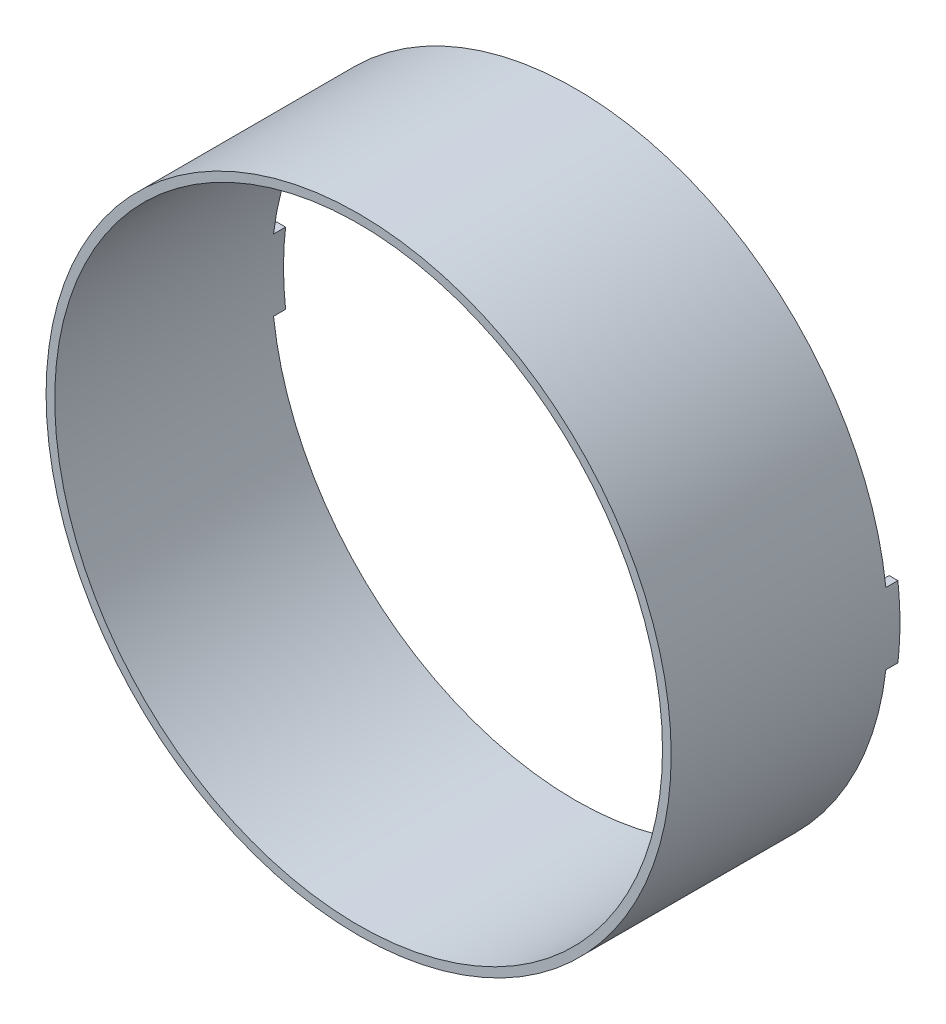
ISO-10303-21;
HEADER;
FILE_DESCRIPTION(('STEP AP214'),'2;1');
FILE_NAME('part.step','',(''),(''),'','','');
FILE_SCHEMA(('AUTOMOTIVE_DESIGN { 1 0 10303 214 1 1 1 1 }'));
ENDSEC;
DATA;
#1=APPLICATION_CONTEXT('core data for automotive mechanical design processes');
#2=APPLICATION_PROTOCOL_DEFINITION('international standard','automotive_design',2000,#1);
#3=PRODUCT_CONTEXT('',#1,'mechanical');
#4=PRODUCT('Part','Part','',(#3));
#5=PRODUCT_RELATED_PRODUCT_CATEGORY('part','',(#4));
#6=PRODUCT_DEFINITION_FORMATION('','',#4);
#7=PRODUCT_DEFINITION_CONTEXT('part definition',#1,'design');
#8=PRODUCT_DEFINITION('design','',#6,#7);
#9=PRODUCT_DEFINITION_SHAPE('','',#8);
#10=(LENGTH_UNIT() NAMED_UNIT(*) SI_UNIT(.MILLI.,.METRE.));
#11=(NAMED_UNIT(*) PLANE_ANGLE_UNIT() SI_UNIT($,.RADIAN.));
#12=(NAMED_UNIT(*) SI_UNIT($,.STERADIAN.) SOLID_ANGLE_UNIT());
#13=UNCERTAINTY_MEASURE_WITH_UNIT(LENGTH_MEASURE(1.E-05),#10,'distance_accuracy_value','');
#14=(GEOMETRIC_REPRESENTATION_CONTEXT(3) GLOBAL_UNCERTAINTY_ASSIGNED_CONTEXT((#13)) GLOBAL_UNIT_ASSIGNED_CONTEXT((#10,
#11,#12)) REPRESENTATION_CONTEXT('',''));
#15=CARTESIAN_POINT('',(0.,0.,0.));
#16=DIRECTION('',(0.,0.,1.));
#17=DIRECTION('',(1.,0.,0.));
#18=AXIS2_PLACEMENT_3D('',#15,#16,#17);
#19=CARTESIAN_POINT('',(0.,39.1553072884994,0.));
#20=DIRECTION('',(0.,0.,1.));
#21=DIRECTION('',(1.,0.,0.));
#22=AXIS2_PLACEMENT_3D('',#19,#20,#21);
#23=PLANE('',#22);
#24=CARTESIAN_POINT('',(0.,39.1553072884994,0.));
#25=DIRECTION('',(0.,0.,1.));
#26=DIRECTION('',(1.,0.,0.));
#27=AXIS2_PLACEMENT_3D('',#24,#25,#26);
#28=CIRCLE('',#27,63.1000000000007);
#29=CARTESIAN_POINT('',(62.6645832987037,46.5553072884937,0.));
#30=VERTEX_POINT('',#29);
#31=CARTESIAN_POINT('',(-62.6645832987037,46.5553072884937,0.));
#32=VERTEX_POINT('',#31);
#33=EDGE_CURVE('E122',#30,#32,#28,.T.);
#34=ORIENTED_EDGE('',*,*,#33,.T.);
#35=DIRECTION('',(-1.,0.,0.));
#36=VECTOR('',#35,1.);
#37=CARTESIAN_POINT('',(-62.6645832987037,46.5553072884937,0.));
#38=LINE('',#37,#36);
#39=CARTESIAN_POINT('',(-64.4767399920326,46.5553072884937,0.));
#40=VERTEX_POINT('',#39);
#41=EDGE_CURVE('E131',#32,#40,#38,.T.);
#42=ORIENTED_EDGE('',*,*,#41,.T.);
#43=CARTESIAN_POINT('',(0.,39.1553072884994,0.));
#44=DIRECTION('',(0.,0.,1.));
#45=DIRECTION('',(1.,0.,0.));
#46=AXIS2_PLACEMENT_3D('',#43,#44,#45);
#47=CIRCLE('',#46,64.9000000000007);
#48=CARTESIAN_POINT('',(64.4767399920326,46.5553072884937,0.));
#49=VERTEX_POINT('',#48);
#50=EDGE_CURVE('E152',#49,#40,#47,.T.);
#51=ORIENTED_EDGE('',*,*,#50,.F.);
#52=DIRECTION('',(-1.,0.,0.));
#53=VECTOR('',#52,1.);
#54=CARTESIAN_POINT('',(64.4767399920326,46.5553072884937,0.));
#55=LINE('',#54,#53);
#56=EDGE_CURVE('E140',#49,#30,#55,.T.);
#57=ORIENTED_EDGE('',*,*,#56,.T.);
#58=EDGE_LOOP('',(#34,#42,#51,#57));
#59=FACE_BOUND('',#58,.T.);
#60=ADVANCED_FACE('F41',(#59),#23,.F.);
#61=CARTESIAN_POINT('',(62.6645832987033,31.7553072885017,-2.5));
#62=DIRECTION('',(0.,-1.,0.));
#63=DIRECTION('',(0.,0.,-1.));
#64=AXIS2_PLACEMENT_3D('',#61,#62,#63);
#65=PLANE('',#64);
#66=DIRECTION('',(1.,0.,0.));
#67=VECTOR('',#66,1.);
#68=CARTESIAN_POINT('',(62.6645832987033,31.7553072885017,0.));
#69=LINE('',#68,#67);
#70=CARTESIAN_POINT('',(62.6645832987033,31.7553072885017,0.));
#71=VERTEX_POINT('',#70);
#72=CARTESIAN_POINT('',(64.4767399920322,31.7553072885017,0.));
#73=VERTEX_POINT('',#72);
#74=EDGE_CURVE('E151',#71,#73,#69,.T.);
#75=ORIENTED_EDGE('',*,*,#74,.F.);
#76=DIRECTION('',(0.,0.,1.));
#77=VECTOR('',#76,1.);
#78=CARTESIAN_POINT('',(62.6645832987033,31.7553072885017,-2.5));
#79=LINE('',#78,#77);
#80=CARTESIAN_POINT('',(62.6645832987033,31.7553072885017,-2.5));
#81=VERTEX_POINT('',#80);
#82=EDGE_CURVE('E11',#81,#71,#79,.T.);
#83=ORIENTED_EDGE('',*,*,#82,.F.);
#84=DIRECTION('',(1.,0.,0.));
#85=VECTOR('',#84,1.);
#86=CARTESIAN_POINT('',(62.6645832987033,31.7553072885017,-2.5));
#87=LINE('',#86,#85);
#88=CARTESIAN_POINT('',(64.4767399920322,31.7553072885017,-2.5));
#89=VERTEX_POINT('',#88);
#90=EDGE_CURVE('E154',#81,#89,#87,.T.);
#91=ORIENTED_EDGE('',*,*,#90,.T.);
#92=DIRECTION('',(0.,0.,1.));
#93=VECTOR('',#92,1.);
#94=CARTESIAN_POINT('',(64.4767399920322,31.7553072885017,-2.5));
#95=LINE('',#94,#93);
#96=EDGE_CURVE('E45',#89,#73,#95,.T.);
#97=ORIENTED_EDGE('',*,*,#96,.T.);
#98=EDGE_LOOP('',(#75,#83,#91,#97));
#99=FACE_BOUND('',#98,.T.);
#100=ADVANCED_FACE('F43',(#99),#65,.T.);
#101=CARTESIAN_POINT('',(0.,39.1553072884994,-2.5));
#102=DIRECTION('',(0.,0.,1.));
#103=DIRECTION('',(1.,0.,0.));
#104=AXIS2_PLACEMENT_3D('',#101,#102,#103);
#105=CYLINDRICAL_SURFACE('',#104,63.1000000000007);
#106=ORIENTED_EDGE('',*,*,#82,.T.);
#107=CARTESIAN_POINT('',(-62.6645832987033,31.7553072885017,0.));
#108=VERTEX_POINT('',#107);
#109=EDGE_CURVE('E84',#108,#71,#28,.T.);
#110=ORIENTED_EDGE('',*,*,#109,.F.);
#111=DIRECTION('',(0.,0.,1.));
#112=VECTOR('',#111,1.);
#113=CARTESIAN_POINT('',(-62.6645832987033,31.7553072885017,-2.5));
#114=LINE('',#113,#112);
#115=CARTESIAN_POINT('',(-62.6645832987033,31.7553072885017,-2.5));
#116=VERTEX_POINT('',#115);
#117=EDGE_CURVE('E128',#116,#108,#114,.T.);
#118=ORIENTED_EDGE('',*,*,#117,.F.);
#119=CARTESIAN_POINT('',(0.,39.1553072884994,-2.5));
#120=DIRECTION('',(0.,0.,1.));
#121=DIRECTION('',(1.,0.,0.));
#122=AXIS2_PLACEMENT_3D('',#119,#120,#121);
#123=CIRCLE('',#122,63.1000000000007);
#124=CARTESIAN_POINT('',(-62.6645832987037,46.5553072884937,-2.5));
#125=VERTEX_POINT('',#124);
#126=EDGE_CURVE('E124',#125,#116,#123,.T.);
#127=ORIENTED_EDGE('',*,*,#126,.F.);
#128=DIRECTION('',(0.,0.,1.));
#129=VECTOR('',#128,1.);
#130=CARTESIAN_POINT('',(-62.6645832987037,46.5553072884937,-2.5));
#131=LINE('',#130,#129);
#132=EDGE_CURVE('E116',#125,#32,#131,.T.);
#133=ORIENTED_EDGE('',*,*,#132,.T.);
#134=ORIENTED_EDGE('',*,*,#33,.F.);
#135=DIRECTION('',(0.,0.,1.));
#136=VECTOR('',#135,1.);
#137=CARTESIAN_POINT('',(62.6645832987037,46.5553072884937,-2.5));
#138=LINE('',#137,#136);
#139=CARTESIAN_POINT('',(62.6645832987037,46.5553072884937,-2.5));
#140=VERTEX_POINT('',#139);
#141=EDGE_CURVE('E50',#140,#30,#138,.T.);
#142=ORIENTED_EDGE('',*,*,#141,.F.);
#143=CARTESIAN_POINT('',(0.,39.1553072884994,-2.5));
#144=DIRECTION('',(0.,0.,1.));
#145=DIRECTION('',(1.,0.,0.));
#146=AXIS2_PLACEMENT_3D('',#143,#144,#145);
#147=CIRCLE('',#146,63.1000000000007);
#148=EDGE_CURVE('E161',#81,#140,#147,.T.);
#149=ORIENTED_EDGE('',*,*,#148,.F.);
#150=EDGE_LOOP('',(#106,#110,#118,#127,#133,#134,#142,#149));
#151=FACE_BOUND('',#150,.T.);
#152=CARTESIAN_POINT('',(0.,39.1553072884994,45.));
#153=DIRECTION('',(0.,0.,1.));
#154=DIRECTION('',(1.,0.,0.));
#155=AXIS2_PLACEMENT_3D('',#152,#153,#154);
#156=CIRCLE('',#155,63.1000000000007);
#157=CARTESIAN_POINT('',(63.1000000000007,39.1553072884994,45.));
#158=VERTEX_POINT('',#157);
#159=EDGE_CURVE('E141',#158,#158,#156,.T.);
#160=ORIENTED_EDGE('',*,*,#159,.T.);
#161=EDGE_LOOP('',(#160));
#162=FACE_BOUND('',#161,.T.);
#163=ADVANCED_FACE('F118',(#151,#162),#105,.F.);
#164=CARTESIAN_POINT('',(64.4767399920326,46.5553072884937,-2.5));
#165=DIRECTION('',(0.,1.,0.));
#166=DIRECTION('',(0.,0.,1.));
#167=AXIS2_PLACEMENT_3D('',#164,#165,#166);
#168=PLANE('',#167);
#169=ORIENTED_EDGE('',*,*,#56,.F.);
#170=DIRECTION('',(0.,0.,1.));
#171=VECTOR('',#170,1.);
#172=CARTESIAN_POINT('',(64.4767399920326,46.5553072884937,-2.5));
#173=LINE('',#172,#171);
#174=CARTESIAN_POINT('',(64.4767399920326,46.5553072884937,-2.5));
#175=VERTEX_POINT('',#174);
#176=EDGE_CURVE('E165',#175,#49,#173,.T.);
#177=ORIENTED_EDGE('',*,*,#176,.F.);
#178=DIRECTION('',(-1.,0.,0.));
#179=VECTOR('',#178,1.);
#180=CARTESIAN_POINT('',(64.4767399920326,46.5553072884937,-2.5));
#181=LINE('',#180,#179);
#182=EDGE_CURVE('E158',#175,#140,#181,.T.);
#183=ORIENTED_EDGE('',*,*,#182,.T.);
#184=ORIENTED_EDGE('',*,*,#141,.T.);
#185=EDGE_LOOP('',(#169,#177,#183,#184));
#186=FACE_BOUND('',#185,.T.);
#187=ADVANCED_FACE('F193',(#186),#168,.T.);
#188=CARTESIAN_POINT('',(0.,39.1553072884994,-2.5));
#189=DIRECTION('',(0.,0.,1.));
#190=DIRECTION('',(1.,0.,0.));
#191=AXIS2_PLACEMENT_3D('',#188,#189,#190);
#192=CYLINDRICAL_SURFACE('',#191,64.9000000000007);
#193=ORIENTED_EDGE('',*,*,#176,.T.);
#194=ORIENTED_EDGE('',*,*,#50,.T.);
#195=DIRECTION('',(0.,0.,1.));
#196=VECTOR('',#195,1.);
#197=CARTESIAN_POINT('',(-64.4767399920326,46.5553072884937,-2.5));
#198=LINE('',#197,#196);
#199=CARTESIAN_POINT('',(-64.4767399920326,46.5553072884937,-2.5));
#200=VERTEX_POINT('',#199);
#201=EDGE_CURVE('E133',#200,#40,#198,.T.);
#202=ORIENTED_EDGE('',*,*,#201,.F.);
#203=CARTESIAN_POINT('',(0.,39.1553072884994,-2.5));
#204=DIRECTION('',(0.,0.,1.));
#205=DIRECTION('',(1.,0.,0.));
#206=AXIS2_PLACEMENT_3D('',#203,#204,#205);
#207=CIRCLE('',#206,64.9000000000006);
#208=CARTESIAN_POINT('',(-64.4767399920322,31.7553072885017,-2.5));
#209=VERTEX_POINT('',#208);
#210=EDGE_CURVE('E174',#200,#209,#207,.T.);
#211=ORIENTED_EDGE('',*,*,#210,.T.);
#212=DIRECTION('',(0.,0.,1.));
#213=VECTOR('',#212,1.);
#214=CARTESIAN_POINT('',(-64.4767399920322,31.7553072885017,-2.5));
#215=LINE('',#214,#213);
#216=CARTESIAN_POINT('',(-64.4767399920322,31.7553072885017,0.));
#217=VERTEX_POINT('',#216);
#218=EDGE_CURVE('E172',#209,#217,#215,.T.);
#219=ORIENTED_EDGE('',*,*,#218,.T.);
#220=EDGE_CURVE('E144',#217,#73,#47,.T.);
#221=ORIENTED_EDGE('',*,*,#220,.T.);
#222=ORIENTED_EDGE('',*,*,#96,.F.);
#223=CARTESIAN_POINT('',(0.,39.1553072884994,-2.5));
#224=DIRECTION('',(0.,0.,1.));
#225=DIRECTION('',(1.,0.,0.));
#226=AXIS2_PLACEMENT_3D('',#223,#224,#225);
#227=CIRCLE('',#226,64.9000000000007);
#228=EDGE_CURVE('E156',#89,#175,#227,.T.);
#229=ORIENTED_EDGE('',*,*,#228,.T.);
#230=EDGE_LOOP('',(#193,#194,#202,#211,#219,#221,#222,#229));
#231=FACE_BOUND('',#230,.T.);
#232=CARTESIAN_POINT('',(0.,39.1553072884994,45.));
#233=DIRECTION('',(0.,0.,1.));
#234=DIRECTION('',(1.,0.,0.));
#235=AXIS2_PLACEMENT_3D('',#232,#233,#234);
#236=CIRCLE('',#235,64.9000000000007);
#237=CARTESIAN_POINT('',(64.9000000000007,39.1553072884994,45.));
#238=VERTEX_POINT('',#237);
#239=EDGE_CURVE('E148',#238,#238,#236,.T.);
#240=ORIENTED_EDGE('',*,*,#239,.F.);
#241=EDGE_LOOP('',(#240));
#242=FACE_BOUND('',#241,.T.);
#243=ADVANCED_FACE('F169',(#231,#242),#192,.T.);
#244=CARTESIAN_POINT('',(0.,39.1553072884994,-2.5));
#245=DIRECTION('',(0.,0.,1.));
#246=DIRECTION('',(1.,0.,0.));
#247=AXIS2_PLACEMENT_3D('',#244,#245,#246);
#248=PLANE('',#247);
#249=ORIENTED_EDGE('',*,*,#90,.F.);
#250=ORIENTED_EDGE('',*,*,#148,.T.);
#251=ORIENTED_EDGE('',*,*,#182,.F.);
#252=ORIENTED_EDGE('',*,*,#228,.F.);
#253=EDGE_LOOP('',(#249,#250,#251,#252));
#254=FACE_BOUND('',#253,.T.);
#255=ADVANCED_FACE('F191',(#254),#248,.F.);
#256=ORIENTED_EDGE('',*,*,#220,.F.);
#257=DIRECTION('',(1.,0.,0.));
#258=VECTOR('',#257,1.);
#259=CARTESIAN_POINT('',(-64.4767399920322,31.7553072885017,0.));
#260=LINE('',#259,#258);
#261=EDGE_CURVE('E58',#217,#108,#260,.T.);
#262=ORIENTED_EDGE('',*,*,#261,.T.);
#263=ORIENTED_EDGE('',*,*,#109,.T.);
#264=ORIENTED_EDGE('',*,*,#74,.T.);
#265=EDGE_LOOP('',(#256,#262,#263,#264));
#266=FACE_BOUND('',#265,.T.);
#267=ADVANCED_FACE('F168',(#266),#23,.F.);
#268=CARTESIAN_POINT('',(0.,39.1553072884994,45.));
#269=DIRECTION('',(0.,0.,1.));
#270=DIRECTION('',(1.,0.,0.));
#271=AXIS2_PLACEMENT_3D('',#268,#269,#270);
#272=PLANE('',#271);
#273=ORIENTED_EDGE('',*,*,#239,.T.);
#274=EDGE_LOOP('',(#273));
#275=FACE_BOUND('',#274,.T.);
#276=ORIENTED_EDGE('',*,*,#159,.F.);
#277=EDGE_LOOP('',(#276));
#278=FACE_BOUND('',#277,.T.);
#279=ADVANCED_FACE('F209',(#275,#278),#272,.T.);
#280=CARTESIAN_POINT('',(-62.6645832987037,46.5553072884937,-2.5));
#281=DIRECTION('',(0.,1.,0.));
#282=DIRECTION('',(0.,0.,1.));
#283=AXIS2_PLACEMENT_3D('',#280,#281,#282);
#284=PLANE('',#283);
#285=ORIENTED_EDGE('',*,*,#41,.F.);
#286=ORIENTED_EDGE('',*,*,#132,.F.);
#287=DIRECTION('',(-1.,0.,0.));
#288=VECTOR('',#287,1.);
#289=CARTESIAN_POINT('',(-62.6645832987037,46.5553072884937,-2.5));
#290=LINE('',#289,#288);
#291=EDGE_CURVE('E181',#125,#200,#290,.T.);
#292=ORIENTED_EDGE('',*,*,#291,.T.);
#293=ORIENTED_EDGE('',*,*,#201,.T.);
#294=EDGE_LOOP('',(#285,#286,#292,#293));
#295=FACE_BOUND('',#294,.T.);
#296=ADVANCED_FACE('F132',(#295),#284,.T.);
#297=CARTESIAN_POINT('',(-64.4767399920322,31.7553072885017,-2.5));
#298=DIRECTION('',(0.,-1.,0.));
#299=DIRECTION('',(0.,0.,-1.));
#300=AXIS2_PLACEMENT_3D('',#297,#298,#299);
#301=PLANE('',#300);
#302=ORIENTED_EDGE('',*,*,#261,.F.);
#303=ORIENTED_EDGE('',*,*,#218,.F.);
#304=DIRECTION('',(1.,0.,0.));
#305=VECTOR('',#304,1.);
#306=CARTESIAN_POINT('',(-64.4767399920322,31.7553072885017,-2.5));
#307=LINE('',#306,#305);
#308=EDGE_CURVE('E184',#209,#116,#307,.T.);
#309=ORIENTED_EDGE('',*,*,#308,.T.);
#310=ORIENTED_EDGE('',*,*,#117,.T.);
#311=EDGE_LOOP('',(#302,#303,#309,#310));
#312=FACE_BOUND('',#311,.T.);
#313=ADVANCED_FACE('F188',(#312),#301,.T.);
#314=CARTESIAN_POINT('',(0.,39.1553072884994,-2.5));
#315=DIRECTION('',(0.,0.,1.));
#316=DIRECTION('',(1.,0.,0.));
#317=AXIS2_PLACEMENT_3D('',#314,#315,#316);
#318=PLANE('',#317);
#319=ORIENTED_EDGE('',*,*,#291,.F.);
#320=ORIENTED_EDGE('',*,*,#126,.T.);
#321=ORIENTED_EDGE('',*,*,#308,.F.);
#322=ORIENTED_EDGE('',*,*,#210,.F.);
#323=EDGE_LOOP('',(#319,#320,#321,#322));
#324=FACE_BOUND('',#323,.T.);
#325=ADVANCED_FACE('F187',(#324),#318,.F.);
#326=CLOSED_SHELL('',(#60,#100,#163,#187,#243,#255,#267,#279,#296,#313,#325));
#327=MANIFOLD_SOLID_BREP('B2',#326);
#328=ADVANCED_BREP_SHAPE_REPRESENTATION('',(#18,#327),#14);
#329=SHAPE_DEFINITION_REPRESENTATION(#9,#328);
ENDSEC;
END-ISO-10303-21;
